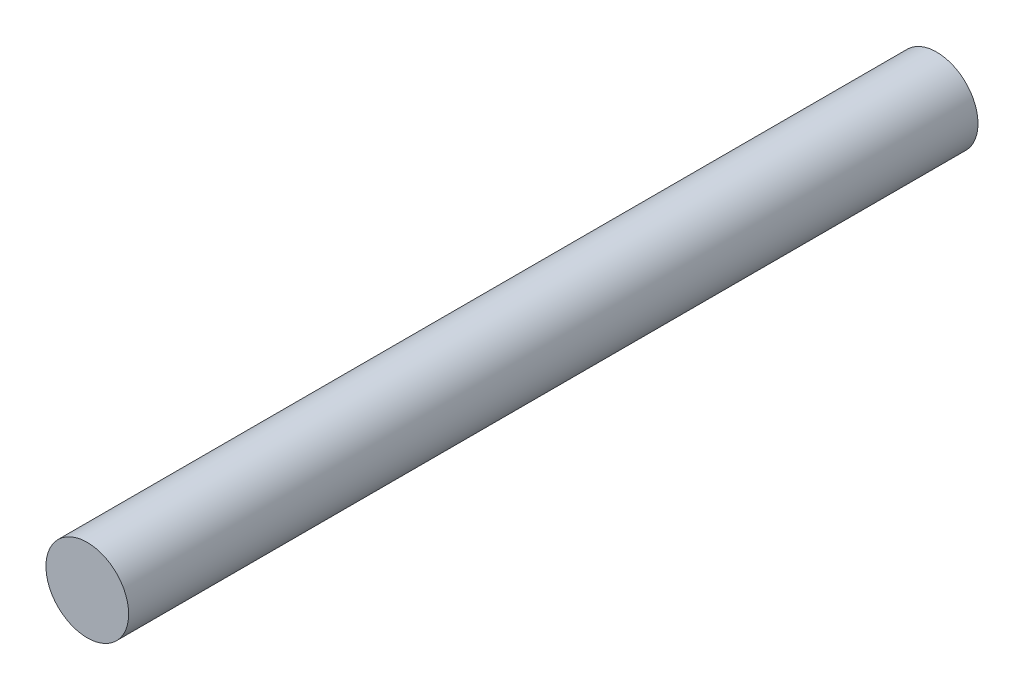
from build123d import *

# Parameters (mm, degrees)
SKETCH3_R           = 1.5875
BOSS_EXTRUDE1_DEPTH = 16.299999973


with BuildPart() as part:
    # Sketch3 → Boss-Extrude1 (new, symmetric)
    with BuildSketch(Plane.XY):
        Circle(SKETCH3_R)
    extrude(amount=BOSS_EXTRUDE1_DEPTH, both=True)


solid = part.part
